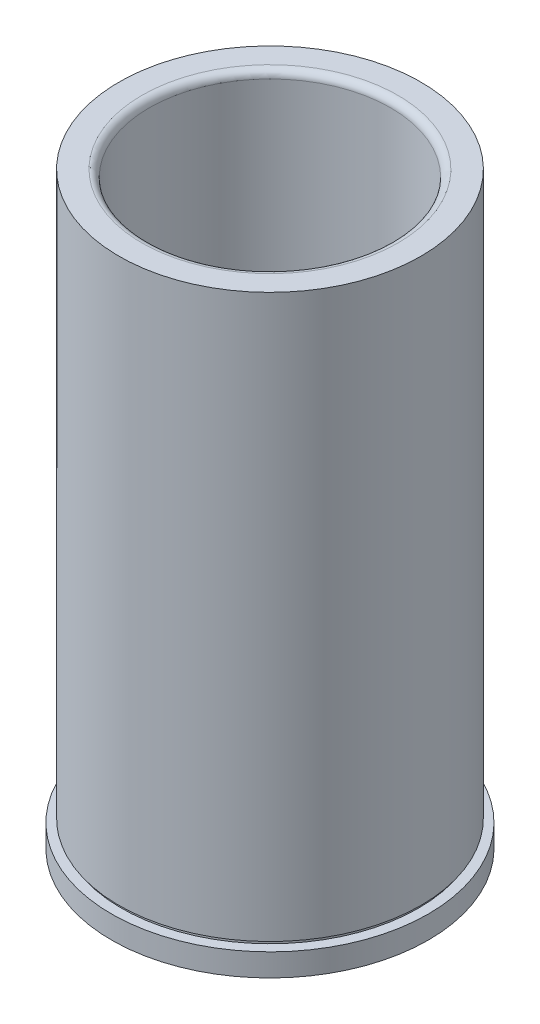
ISO-10303-21;
HEADER;
FILE_DESCRIPTION(('STEP AP214'),'2;1');
FILE_NAME('part.step','',(''),(''),'','','');
FILE_SCHEMA(('AUTOMOTIVE_DESIGN { 1 0 10303 214 1 1 1 1 }'));
ENDSEC;
DATA;
#1=APPLICATION_CONTEXT('core data for automotive mechanical design processes');
#2=APPLICATION_PROTOCOL_DEFINITION('international standard','automotive_design',2000,#1);
#3=PRODUCT_CONTEXT('',#1,'mechanical');
#4=PRODUCT('Part','Part','',(#3));
#5=PRODUCT_RELATED_PRODUCT_CATEGORY('part','',(#4));
#6=PRODUCT_DEFINITION_FORMATION('','',#4);
#7=PRODUCT_DEFINITION_CONTEXT('part definition',#1,'design');
#8=PRODUCT_DEFINITION('design','',#6,#7);
#9=PRODUCT_DEFINITION_SHAPE('','',#8);
#10=(LENGTH_UNIT() NAMED_UNIT(*) SI_UNIT(.MILLI.,.METRE.));
#11=(NAMED_UNIT(*) PLANE_ANGLE_UNIT() SI_UNIT($,.RADIAN.));
#12=(NAMED_UNIT(*) SI_UNIT($,.STERADIAN.) SOLID_ANGLE_UNIT());
#13=UNCERTAINTY_MEASURE_WITH_UNIT(LENGTH_MEASURE(1.E-05),#10,'distance_accuracy_value','');
#14=(GEOMETRIC_REPRESENTATION_CONTEXT(3) GLOBAL_UNCERTAINTY_ASSIGNED_CONTEXT((#13)) GLOBAL_UNIT_ASSIGNED_CONTEXT((#10,
#11,#12)) REPRESENTATION_CONTEXT('',''));
#15=CARTESIAN_POINT('',(0.,0.,0.));
#16=DIRECTION('',(0.,0.,1.));
#17=DIRECTION('',(1.,0.,0.));
#18=AXIS2_PLACEMENT_3D('',#15,#16,#17);
#19=CARTESIAN_POINT('',(-31.75635,123.825,0.));
#20=DIRECTION('',(0.,-1.,0.));
#21=DIRECTION('',(1.,0.,0.));
#22=AXIS2_PLACEMENT_3D('',#19,#20,#21);
#23=PLANE('',#22);
#24=CARTESIAN_POINT('',(-4.3233292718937E-13,123.825,0.));
#25=DIRECTION('',(0.,-1.,0.));
#26=DIRECTION('',(1.,0.,0.));
#27=AXIS2_PLACEMENT_3D('',#24,#25,#26);
#28=CIRCLE('',#27,26.9303499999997);
#29=CARTESIAN_POINT('',(26.9303499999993,123.825,0.));
#30=VERTEX_POINT('',#29);
#31=EDGE_CURVE('E36',#30,#30,#28,.T.);
#32=ORIENTED_EDGE('',*,*,#31,.T.);
#33=EDGE_LOOP('',(#32));
#34=FACE_BOUND('',#33,.T.);
#35=CARTESIAN_POINT('',(-4.3233292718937E-13,123.825,0.));
#36=DIRECTION('',(0.,-1.,0.));
#37=DIRECTION('',(1.,0.,0.));
#38=AXIS2_PLACEMENT_3D('',#35,#36,#37);
#39=CIRCLE('',#38,31.7563499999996);
#40=CARTESIAN_POINT('',(31.7563499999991,123.825,0.));
#41=VERTEX_POINT('',#40);
#42=EDGE_CURVE('E40',#41,#41,#39,.T.);
#43=ORIENTED_EDGE('',*,*,#42,.F.);
#44=EDGE_LOOP('',(#43));
#45=FACE_BOUND('',#44,.T.);
#46=ADVANCED_FACE('F29',(#34,#45),#23,.F.);
#47=CARTESIAN_POINT('',(3.49148336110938E-12,-1000.,0.));
#48=DIRECTION('',(0.,-1.,0.));
#49=DIRECTION('',(1.,0.,0.));
#50=AXIS2_PLACEMENT_3D('',#47,#48,#49);
#51=CYLINDRICAL_SURFACE('',#50,31.7563499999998);
#52=CARTESIAN_POINT('',(0.,5.52449999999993,0.));
#53=DIRECTION('',(0.,-1.,0.));
#54=DIRECTION('',(1.,0.,0.));
#55=AXIS2_PLACEMENT_3D('',#52,#53,#54);
#56=CIRCLE('',#55,31.75635);
#57=CARTESIAN_POINT('',(31.7563499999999,5.52450000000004,0.));
#58=VERTEX_POINT('',#57);
#59=EDGE_CURVE('E44',#58,#58,#56,.T.);
#60=ORIENTED_EDGE('',*,*,#59,.F.);
#61=EDGE_LOOP('',(#60));
#62=FACE_BOUND('',#61,.T.);
#63=ORIENTED_EDGE('',*,*,#42,.T.);
#64=EDGE_LOOP('',(#63));
#65=FACE_BOUND('',#64,.T.);
#66=ADVANCED_FACE('F121',(#62,#65),#51,.T.);
#67=CARTESIAN_POINT('',(-31.75635,5.52449999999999,0.));
#68=DIRECTION('',(0.,1.,0.));
#69=DIRECTION('',(-1.,0.,0.));
#70=AXIS2_PLACEMENT_3D('',#67,#68,#69);
#71=PLANE('',#70);
#72=CARTESIAN_POINT('',(0.,5.52449999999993,0.));
#73=DIRECTION('',(0.,-1.,0.));
#74=DIRECTION('',(1.,0.,0.));
#75=AXIS2_PLACEMENT_3D('',#72,#73,#74);
#76=CIRCLE('',#75,31.24835);
#77=CARTESIAN_POINT('',(31.2483499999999,5.52450000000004,0.));
#78=VERTEX_POINT('',#77);
#79=EDGE_CURVE('E49',#78,#78,#76,.T.);
#80=ORIENTED_EDGE('',*,*,#79,.F.);
#81=EDGE_LOOP('',(#80));
#82=FACE_BOUND('',#81,.T.);
#83=ORIENTED_EDGE('',*,*,#59,.T.);
#84=EDGE_LOOP('',(#83));
#85=FACE_BOUND('',#84,.T.);
#86=ADVANCED_FACE('F115',(#82,#85),#71,.F.);
#87=CARTESIAN_POINT('',(3.49148336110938E-12,-1000.,0.));
#88=DIRECTION('',(0.,-1.,0.));
#89=DIRECTION('',(1.,0.,0.));
#90=AXIS2_PLACEMENT_3D('',#87,#88,#89);
#91=CYLINDRICAL_SURFACE('',#90,31.24835);
#92=CARTESIAN_POINT('',(0.,4.7625,0.));
#93=DIRECTION('',(0.,-1.,0.));
#94=DIRECTION('',(1.,0.,0.));
#95=AXIS2_PLACEMENT_3D('',#92,#93,#94);
#96=CIRCLE('',#95,31.24835);
#97=CARTESIAN_POINT('',(31.24835,4.76250000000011,0.));
#98=VERTEX_POINT('',#97);
#99=EDGE_CURVE('E52',#98,#98,#96,.T.);
#100=ORIENTED_EDGE('',*,*,#99,.F.);
#101=EDGE_LOOP('',(#100));
#102=FACE_BOUND('',#101,.T.);
#103=ORIENTED_EDGE('',*,*,#79,.T.);
#104=EDGE_LOOP('',(#103));
#105=FACE_BOUND('',#104,.T.);
#106=ADVANCED_FACE('F109',(#102,#105),#91,.T.);
#107=CARTESIAN_POINT('',(-33.3375,4.76249999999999,0.));
#108=DIRECTION('',(0.,-1.,0.));
#109=DIRECTION('',(1.,0.,0.));
#110=AXIS2_PLACEMENT_3D('',#107,#108,#109);
#111=PLANE('',#110);
#112=CARTESIAN_POINT('',(0.,4.76250000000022,0.));
#113=DIRECTION('',(0.,-1.,0.));
#114=DIRECTION('',(1.,0.,0.));
#115=AXIS2_PLACEMENT_3D('',#112,#113,#114);
#116=CIRCLE('',#115,33.3375);
#117=CARTESIAN_POINT('',(33.3375,4.76250000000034,0.));
#118=VERTEX_POINT('',#117);
#119=EDGE_CURVE('E55',#118,#118,#116,.T.);
#120=ORIENTED_EDGE('',*,*,#119,.F.);
#121=EDGE_LOOP('',(#120));
#122=FACE_BOUND('',#121,.T.);
#123=ORIENTED_EDGE('',*,*,#99,.T.);
#124=EDGE_LOOP('',(#123));
#125=FACE_BOUND('',#124,.T.);
#126=ADVANCED_FACE('F103',(#122,#125),#111,.F.);
#127=CARTESIAN_POINT('',(3.49148336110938E-12,-1000.,0.));
#128=DIRECTION('',(0.,-1.,0.));
#129=DIRECTION('',(1.,0.,0.));
#130=AXIS2_PLACEMENT_3D('',#127,#128,#129);
#131=CYLINDRICAL_SURFACE('',#130,33.3375);
#132=CARTESIAN_POINT('',(0.,2.22044604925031E-13,0.));
#133=DIRECTION('',(0.,-1.,0.));
#134=DIRECTION('',(1.,0.,0.));
#135=AXIS2_PLACEMENT_3D('',#132,#133,#134);
#136=CIRCLE('',#135,33.3375);
#137=CARTESIAN_POINT('',(33.3375,3.38441931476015E-13,0.));
#138=VERTEX_POINT('',#137);
#139=EDGE_CURVE('E58',#138,#138,#136,.T.);
#140=ORIENTED_EDGE('',*,*,#139,.F.);
#141=EDGE_LOOP('',(#140));
#142=FACE_BOUND('',#141,.T.);
#143=ORIENTED_EDGE('',*,*,#119,.T.);
#144=EDGE_LOOP('',(#143));
#145=FACE_BOUND('',#144,.T.);
#146=ADVANCED_FACE('F97',(#142,#145),#131,.T.);
#147=CARTESIAN_POINT('',(-27.94635,0.,0.));
#148=DIRECTION('',(0.,1.,0.));
#149=DIRECTION('',(-1.,0.,0.));
#150=AXIS2_PLACEMENT_3D('',#147,#148,#149);
#151=PLANE('',#150);
#152=CARTESIAN_POINT('',(0.,0.,0.));
#153=DIRECTION('',(0.,-1.,0.));
#154=DIRECTION('',(1.,0.,0.));
#155=AXIS2_PLACEMENT_3D('',#152,#153,#154);
#156=CIRCLE('',#155,27.94635);
#157=CARTESIAN_POINT('',(27.94635,0.,0.));
#158=VERTEX_POINT('',#157);
#159=EDGE_CURVE('E61',#158,#158,#156,.T.);
#160=ORIENTED_EDGE('',*,*,#159,.F.);
#161=EDGE_LOOP('',(#160));
#162=FACE_BOUND('',#161,.T.);
#163=ORIENTED_EDGE('',*,*,#139,.T.);
#164=EDGE_LOOP('',(#163));
#165=FACE_BOUND('',#164,.T.);
#166=ADVANCED_FACE('F91',(#162,#165),#151,.F.);
#167=CARTESIAN_POINT('',(0.,0.,0.));
#168=DIRECTION('',(0.,-1.,0.));
#169=DIRECTION('',(1.,0.,0.));
#170=AXIS2_PLACEMENT_3D('',#167,#168,#169);
#171=CONICAL_SURFACE('',#170,27.94635,0.78539816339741);
#172=CARTESIAN_POINT('',(0.,1.2700000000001,0.));
#173=DIRECTION('',(0.,-1.,0.));
#174=DIRECTION('',(1.,0.,0.));
#175=AXIS2_PLACEMENT_3D('',#172,#173,#174);
#176=CIRCLE('',#175,26.67635);
#177=CARTESIAN_POINT('',(26.67635,1.2700000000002,0.));
#178=VERTEX_POINT('',#177);
#179=EDGE_CURVE('E64',#178,#178,#176,.T.);
#180=ORIENTED_EDGE('',*,*,#179,.F.);
#181=EDGE_LOOP('',(#180));
#182=FACE_BOUND('',#181,.T.);
#183=ORIENTED_EDGE('',*,*,#159,.T.);
#184=EDGE_LOOP('',(#183));
#185=FACE_BOUND('',#184,.T.);
#186=ADVANCED_FACE('F85',(#182,#185),#171,.F.);
#187=CARTESIAN_POINT('',(3.49148336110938E-12,-1000.,0.));
#188=DIRECTION('',(0.,-1.,0.));
#189=DIRECTION('',(1.,0.,0.));
#190=AXIS2_PLACEMENT_3D('',#187,#188,#189);
#191=CYLINDRICAL_SURFACE('',#190,26.6763499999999);
#192=CARTESIAN_POINT('',(0.,20.9550000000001,0.));
#193=DIRECTION('',(0.,-1.,0.));
#194=DIRECTION('',(1.,0.,0.));
#195=AXIS2_PLACEMENT_3D('',#192,#193,#194);
#196=CIRCLE('',#195,26.6763499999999);
#197=CARTESIAN_POINT('',(26.6763499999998,20.9550000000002,0.));
#198=VERTEX_POINT('',#197);
#199=EDGE_CURVE('E67',#198,#198,#196,.T.);
#200=ORIENTED_EDGE('',*,*,#199,.F.);
#201=EDGE_LOOP('',(#200));
#202=FACE_BOUND('',#201,.T.);
#203=ORIENTED_EDGE('',*,*,#179,.T.);
#204=EDGE_LOOP('',(#203));
#205=FACE_BOUND('',#204,.T.);
#206=ADVANCED_FACE('F79',(#202,#205),#191,.F.);
#207=CARTESIAN_POINT('',(0.,20.955,0.));
#208=DIRECTION('',(0.,-1.,0.));
#209=DIRECTION('',(1.,0.,0.));
#210=AXIS2_PLACEMENT_3D('',#207,#208,#209);
#211=TOROIDAL_SURFACE('',#210,25.4063499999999,1.27);
#212=CARTESIAN_POINT('',(0.,22.2249999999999,0.));
#213=DIRECTION('',(0.,-1.,0.));
#214=DIRECTION('',(1.,0.,0.));
#215=AXIS2_PLACEMENT_3D('',#212,#213,#214);
#216=CIRCLE('',#215,25.4063499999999);
#217=CARTESIAN_POINT('',(25.4063499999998,22.225,0.));
#218=VERTEX_POINT('',#217);
#219=EDGE_CURVE('E70',#218,#218,#216,.T.);
#220=ORIENTED_EDGE('',*,*,#219,.F.);
#221=EDGE_LOOP('',(#220));
#222=FACE_BOUND('',#221,.T.);
#223=ORIENTED_EDGE('',*,*,#199,.T.);
#224=EDGE_LOOP('',(#223));
#225=FACE_BOUND('',#224,.T.);
#226=ADVANCED_FACE('F76',(#222,#225),#211,.F.);
#227=CARTESIAN_POINT('',(3.49148336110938E-12,-1000.,0.));
#228=DIRECTION('',(0.,-1.,0.));
#229=DIRECTION('',(1.,0.,0.));
#230=AXIS2_PLACEMENT_3D('',#227,#228,#229);
#231=CYLINDRICAL_SURFACE('',#230,25.4063499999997);
#232=CARTESIAN_POINT('',(-4.27011906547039E-13,122.301,0.));
#233=DIRECTION('',(0.,-1.,0.));
#234=DIRECTION('',(1.,0.,0.));
#235=AXIS2_PLACEMENT_3D('',#232,#233,#234);
#236=CIRCLE('',#235,25.4063499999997);
#237=CARTESIAN_POINT('',(25.4063499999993,122.301,0.));
#238=VERTEX_POINT('',#237);
#239=EDGE_CURVE('E10',#238,#238,#236,.F.);
#240=ORIENTED_EDGE('',*,*,#239,.T.);
#241=EDGE_LOOP('',(#240));
#242=FACE_BOUND('',#241,.T.);
#243=ORIENTED_EDGE('',*,*,#219,.T.);
#244=EDGE_LOOP('',(#243));
#245=FACE_BOUND('',#244,.T.);
#246=ADVANCED_FACE('F74',(#242,#245),#231,.F.);
#247=CARTESIAN_POINT('',(-4.27011906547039E-13,122.301,0.));
#248=DIRECTION('',(0.,-1.,0.));
#249=DIRECTION('',(1.,0.,0.));
#250=AXIS2_PLACEMENT_3D('',#247,#248,#249);
#251=TOROIDAL_SURFACE('',#250,26.9303499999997,1.524);
#252=ORIENTED_EDGE('',*,*,#239,.F.);
#253=EDGE_LOOP('',(#252));
#254=FACE_BOUND('',#253,.T.);
#255=ORIENTED_EDGE('',*,*,#31,.F.);
#256=EDGE_LOOP('',(#255));
#257=FACE_BOUND('',#256,.T.);
#258=ADVANCED_FACE('F31',(#254,#257),#251,.T.);
#259=CLOSED_SHELL('',(#46,#66,#86,#106,#126,#146,#166,#186,#206,#226,#246,#258));
#260=MANIFOLD_SOLID_BREP('B2',#259);
#261=ADVANCED_BREP_SHAPE_REPRESENTATION('',(#18,#260),#14);
#262=SHAPE_DEFINITION_REPRESENTATION(#9,#261);
ENDSEC;
END-ISO-10303-21;
